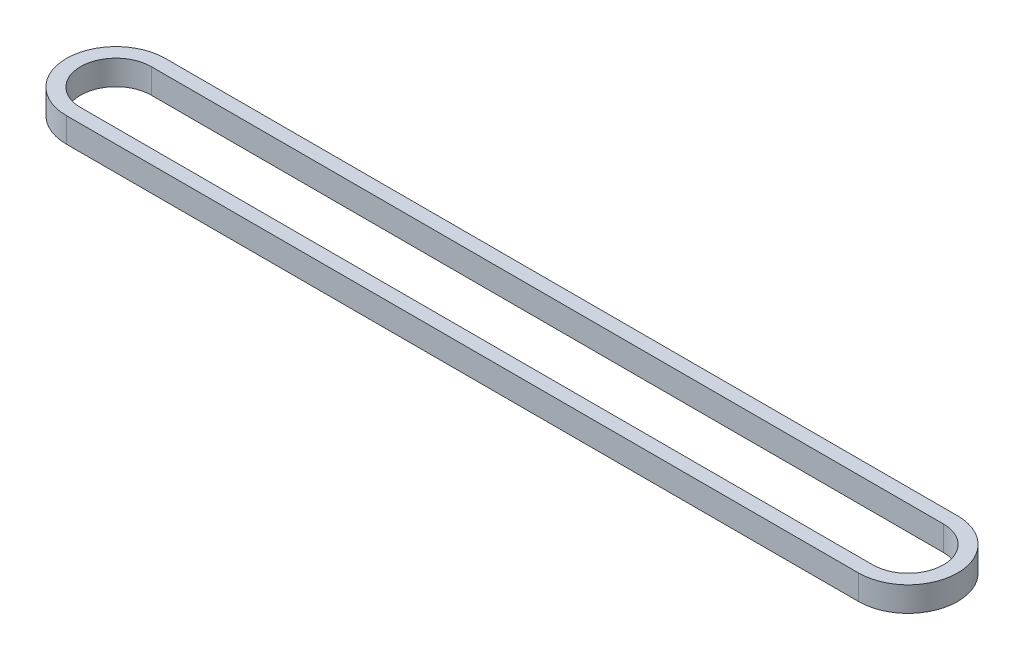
ISO-10303-21;
HEADER;
FILE_DESCRIPTION(('STEP AP214'),'2;1');
FILE_NAME('part.step','',(''),(''),'','','');
FILE_SCHEMA(('AUTOMOTIVE_DESIGN { 1 0 10303 214 1 1 1 1 }'));
ENDSEC;
DATA;
#1=APPLICATION_CONTEXT('core data for automotive mechanical design processes');
#2=APPLICATION_PROTOCOL_DEFINITION('international standard','automotive_design',2000,#1);
#3=PRODUCT_CONTEXT('',#1,'mechanical');
#4=PRODUCT('Part','Part','',(#3));
#5=PRODUCT_RELATED_PRODUCT_CATEGORY('part','',(#4));
#6=PRODUCT_DEFINITION_FORMATION('','',#4);
#7=PRODUCT_DEFINITION_CONTEXT('part definition',#1,'design');
#8=PRODUCT_DEFINITION('design','',#6,#7);
#9=PRODUCT_DEFINITION_SHAPE('','',#8);
#10=(LENGTH_UNIT() NAMED_UNIT(*) SI_UNIT(.MILLI.,.METRE.));
#11=(NAMED_UNIT(*) PLANE_ANGLE_UNIT() SI_UNIT($,.RADIAN.));
#12=(NAMED_UNIT(*) SI_UNIT($,.STERADIAN.) SOLID_ANGLE_UNIT());
#13=UNCERTAINTY_MEASURE_WITH_UNIT(LENGTH_MEASURE(1.E-05),#10,'distance_accuracy_value','');
#14=(GEOMETRIC_REPRESENTATION_CONTEXT(3) GLOBAL_UNCERTAINTY_ASSIGNED_CONTEXT((#13)) GLOBAL_UNIT_ASSIGNED_CONTEXT((#10,
#11,#12)) REPRESENTATION_CONTEXT('',''));
#15=CARTESIAN_POINT('',(0.,0.,0.));
#16=DIRECTION('',(0.,0.,1.));
#17=DIRECTION('',(1.,0.,0.));
#18=AXIS2_PLACEMENT_3D('',#15,#16,#17);
#19=CARTESIAN_POINT('',(0.,3.5,0.));
#20=DIRECTION('',(0.,1.,0.));
#21=DIRECTION('',(0.,0.,1.));
#22=AXIS2_PLACEMENT_3D('',#19,#20,#21);
#23=PLANE('',#22);
#24=CARTESIAN_POINT('',(0.,3.5,0.));
#25=DIRECTION('',(0.,1.,0.));
#26=DIRECTION('',(0.,0.,1.));
#27=AXIS2_PLACEMENT_3D('',#24,#25,#26);
#28=CIRCLE('',#27,7.);
#29=CARTESIAN_POINT('',(0.,3.5,7.));
#30=VERTEX_POINT('',#29);
#31=CARTESIAN_POINT('',(0.,3.5,-7.));
#32=VERTEX_POINT('',#31);
#33=EDGE_CURVE('E159',#30,#32,#28,.T.);
#34=ORIENTED_EDGE('',*,*,#33,.T.);
#35=DIRECTION('',(-1.,0.,0.));
#36=VECTOR('',#35,1.);
#37=CARTESIAN_POINT('',(0.,3.5,-7.));
#38=LINE('',#37,#36);
#39=CARTESIAN_POINT('',(-112.,3.5,-6.99999999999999));
#40=VERTEX_POINT('',#39);
#41=EDGE_CURVE('E163',#32,#40,#38,.T.);
#42=ORIENTED_EDGE('',*,*,#41,.T.);
#43=CARTESIAN_POINT('',(-112.,3.5,0.));
#44=DIRECTION('',(0.,1.,0.));
#45=DIRECTION('',(0.,0.,1.));
#46=AXIS2_PLACEMENT_3D('',#43,#44,#45);
#47=CIRCLE('',#46,7.);
#48=CARTESIAN_POINT('',(-112.,3.5,7.00000000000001));
#49=VERTEX_POINT('',#48);
#50=EDGE_CURVE('E167',#40,#49,#47,.T.);
#51=ORIENTED_EDGE('',*,*,#50,.T.);
#52=DIRECTION('',(1.,0.,0.));
#53=VECTOR('',#52,1.);
#54=CARTESIAN_POINT('',(0.,3.5,7.));
#55=LINE('',#54,#53);
#56=EDGE_CURVE('E170',#49,#30,#55,.T.);
#57=ORIENTED_EDGE('',*,*,#56,.T.);
#58=EDGE_LOOP('',(#34,#42,#51,#57));
#59=FACE_BOUND('',#58,.T.);
#60=DIRECTION('',(-1.,0.,0.));
#61=VECTOR('',#60,1.);
#62=CARTESIAN_POINT('',(0.,3.5,-5.));
#63=LINE('',#62,#61);
#64=CARTESIAN_POINT('',(0.,3.5,-5.));
#65=VERTEX_POINT('',#64);
#66=CARTESIAN_POINT('',(-112.,3.5,-4.99999999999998));
#67=VERTEX_POINT('',#66);
#68=EDGE_CURVE('E120',#65,#67,#63,.T.);
#69=ORIENTED_EDGE('',*,*,#68,.F.);
#70=CARTESIAN_POINT('',(0.,3.5,0.));
#71=DIRECTION('',(0.,1.,0.));
#72=DIRECTION('',(0.,0.,1.));
#73=AXIS2_PLACEMENT_3D('',#70,#71,#72);
#74=CIRCLE('',#73,5.);
#75=CARTESIAN_POINT('',(0.,3.5,5.));
#76=VERTEX_POINT('',#75);
#77=EDGE_CURVE('E111',#76,#65,#74,.T.);
#78=ORIENTED_EDGE('',*,*,#77,.F.);
#79=DIRECTION('',(1.,0.,0.));
#80=VECTOR('',#79,1.);
#81=CARTESIAN_POINT('',(0.,3.5,5.));
#82=LINE('',#81,#80);
#83=CARTESIAN_POINT('',(-112.,3.5,5.00000000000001));
#84=VERTEX_POINT('',#83);
#85=EDGE_CURVE('E137',#84,#76,#82,.T.);
#86=ORIENTED_EDGE('',*,*,#85,.F.);
#87=CARTESIAN_POINT('',(-112.,3.5,0.));
#88=DIRECTION('',(0.,1.,0.));
#89=DIRECTION('',(0.,0.,1.));
#90=AXIS2_PLACEMENT_3D('',#87,#88,#89);
#91=CIRCLE('',#90,5.);
#92=EDGE_CURVE('E133',#67,#84,#91,.T.);
#93=ORIENTED_EDGE('',*,*,#92,.F.);
#94=EDGE_LOOP('',(#69,#78,#86,#93));
#95=FACE_BOUND('',#94,.T.);
#96=ADVANCED_FACE('F45',(#59,#95),#23,.T.);
#97=CARTESIAN_POINT('',(0.,0.,0.));
#98=DIRECTION('',(0.,1.,0.));
#99=DIRECTION('',(0.,0.,1.));
#100=AXIS2_PLACEMENT_3D('',#97,#98,#99);
#101=PLANE('',#100);
#102=CARTESIAN_POINT('',(0.,0.,0.));
#103=DIRECTION('',(0.,1.,0.));
#104=DIRECTION('',(0.,0.,1.));
#105=AXIS2_PLACEMENT_3D('',#102,#103,#104);
#106=CIRCLE('',#105,7.);
#107=CARTESIAN_POINT('',(0.,0.,7.));
#108=VERTEX_POINT('',#107);
#109=CARTESIAN_POINT('',(0.,0.,-7.));
#110=VERTEX_POINT('',#109);
#111=EDGE_CURVE('E129',#108,#110,#106,.T.);
#112=ORIENTED_EDGE('',*,*,#111,.F.);
#113=DIRECTION('',(1.,0.,0.));
#114=VECTOR('',#113,1.);
#115=CARTESIAN_POINT('',(0.,0.,7.));
#116=LINE('',#115,#114);
#117=CARTESIAN_POINT('',(-112.,0.,7.00000000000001));
#118=VERTEX_POINT('',#117);
#119=EDGE_CURVE('E164',#118,#108,#116,.T.);
#120=ORIENTED_EDGE('',*,*,#119,.F.);
#121=CARTESIAN_POINT('',(-112.,0.,0.));
#122=DIRECTION('',(0.,1.,0.));
#123=DIRECTION('',(0.,0.,1.));
#124=AXIS2_PLACEMENT_3D('',#121,#122,#123);
#125=CIRCLE('',#124,7.);
#126=CARTESIAN_POINT('',(-112.,0.,-6.99999999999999));
#127=VERTEX_POINT('',#126);
#128=EDGE_CURVE('E180',#127,#118,#125,.T.);
#129=ORIENTED_EDGE('',*,*,#128,.F.);
#130=DIRECTION('',(-1.,0.,0.));
#131=VECTOR('',#130,1.);
#132=CARTESIAN_POINT('',(0.,0.,-7.));
#133=LINE('',#132,#131);
#134=EDGE_CURVE('E177',#110,#127,#133,.T.);
#135=ORIENTED_EDGE('',*,*,#134,.F.);
#136=EDGE_LOOP('',(#112,#120,#129,#135));
#137=FACE_BOUND('',#136,.T.);
#138=CARTESIAN_POINT('',(0.,0.,0.));
#139=DIRECTION('',(0.,1.,0.));
#140=DIRECTION('',(0.,0.,1.));
#141=AXIS2_PLACEMENT_3D('',#138,#139,#140);
#142=CIRCLE('',#141,5.);
#143=CARTESIAN_POINT('',(0.,0.,5.));
#144=VERTEX_POINT('',#143);
#145=CARTESIAN_POINT('',(0.,0.,-5.));
#146=VERTEX_POINT('',#145);
#147=EDGE_CURVE('E69',#144,#146,#142,.T.);
#148=ORIENTED_EDGE('',*,*,#147,.T.);
#149=DIRECTION('',(-1.,0.,0.));
#150=VECTOR('',#149,1.);
#151=CARTESIAN_POINT('',(0.,0.,-5.));
#152=LINE('',#151,#150);
#153=CARTESIAN_POINT('',(-112.,0.,-4.99999999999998));
#154=VERTEX_POINT('',#153);
#155=EDGE_CURVE('E127',#146,#154,#152,.T.);
#156=ORIENTED_EDGE('',*,*,#155,.T.);
#157=CARTESIAN_POINT('',(-112.,0.,0.));
#158=DIRECTION('',(0.,1.,0.));
#159=DIRECTION('',(0.,0.,1.));
#160=AXIS2_PLACEMENT_3D('',#157,#158,#159);
#161=CIRCLE('',#160,5.);
#162=CARTESIAN_POINT('',(-112.,0.,5.00000000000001));
#163=VERTEX_POINT('',#162);
#164=EDGE_CURVE('E146',#154,#163,#161,.T.);
#165=ORIENTED_EDGE('',*,*,#164,.T.);
#166=DIRECTION('',(1.,0.,0.));
#167=VECTOR('',#166,1.);
#168=CARTESIAN_POINT('',(0.,0.,5.));
#169=LINE('',#168,#167);
#170=EDGE_CURVE('E121',#163,#144,#169,.T.);
#171=ORIENTED_EDGE('',*,*,#170,.T.);
#172=EDGE_LOOP('',(#148,#156,#165,#171));
#173=FACE_BOUND('',#172,.T.);
#174=ADVANCED_FACE('F203',(#137,#173),#101,.F.);
#175=CARTESIAN_POINT('',(0.,3.5,0.));
#176=DIRECTION('',(0.,-1.,0.));
#177=DIRECTION('',(0.,0.,-1.));
#178=AXIS2_PLACEMENT_3D('',#175,#176,#177);
#179=CYLINDRICAL_SURFACE('',#178,7.);
#180=ORIENTED_EDGE('',*,*,#111,.T.);
#181=DIRECTION('',(0.,-1.,0.));
#182=VECTOR('',#181,1.);
#183=CARTESIAN_POINT('',(0.,3.5,-7.));
#184=LINE('',#183,#182);
#185=EDGE_CURVE('E11',#32,#110,#184,.T.);
#186=ORIENTED_EDGE('',*,*,#185,.F.);
#187=ORIENTED_EDGE('',*,*,#33,.F.);
#188=DIRECTION('',(0.,-1.,0.));
#189=VECTOR('',#188,1.);
#190=CARTESIAN_POINT('',(0.,3.5,7.));
#191=LINE('',#190,#189);
#192=EDGE_CURVE('E173',#30,#108,#191,.T.);
#193=ORIENTED_EDGE('',*,*,#192,.T.);
#194=EDGE_LOOP('',(#180,#186,#187,#193));
#195=FACE_BOUND('',#194,.T.);
#196=ADVANCED_FACE('F47',(#195),#179,.T.);
#197=CARTESIAN_POINT('',(0.,3.5,-7.));
#198=DIRECTION('',(0.,0.,1.));
#199=DIRECTION('',(1.,0.,0.));
#200=AXIS2_PLACEMENT_3D('',#197,#198,#199);
#201=PLANE('',#200);
#202=ORIENTED_EDGE('',*,*,#134,.T.);
#203=DIRECTION('',(0.,-1.,0.));
#204=VECTOR('',#203,1.);
#205=CARTESIAN_POINT('',(-112.,3.5,-6.99999999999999));
#206=LINE('',#205,#204);
#207=EDGE_CURVE('E54',#40,#127,#206,.T.);
#208=ORIENTED_EDGE('',*,*,#207,.F.);
#209=ORIENTED_EDGE('',*,*,#41,.F.);
#210=ORIENTED_EDGE('',*,*,#185,.T.);
#211=EDGE_LOOP('',(#202,#208,#209,#210));
#212=FACE_BOUND('',#211,.T.);
#213=ADVANCED_FACE('F213',(#212),#201,.F.);
#214=CARTESIAN_POINT('',(-112.,3.5,0.));
#215=DIRECTION('',(0.,-1.,0.));
#216=DIRECTION('',(0.,0.,-1.));
#217=AXIS2_PLACEMENT_3D('',#214,#215,#216);
#218=CYLINDRICAL_SURFACE('',#217,7.);
#219=ORIENTED_EDGE('',*,*,#128,.T.);
#220=DIRECTION('',(0.,-1.,0.));
#221=VECTOR('',#220,1.);
#222=CARTESIAN_POINT('',(-112.,3.5,7.00000000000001));
#223=LINE('',#222,#221);
#224=EDGE_CURVE('E188',#49,#118,#223,.T.);
#225=ORIENTED_EDGE('',*,*,#224,.F.);
#226=ORIENTED_EDGE('',*,*,#50,.F.);
#227=ORIENTED_EDGE('',*,*,#207,.T.);
#228=EDGE_LOOP('',(#219,#225,#226,#227));
#229=FACE_BOUND('',#228,.T.);
#230=ADVANCED_FACE('F197',(#229),#218,.T.);
#231=CARTESIAN_POINT('',(0.,3.5,7.));
#232=DIRECTION('',(0.,0.,-1.));
#233=DIRECTION('',(-1.,0.,0.));
#234=AXIS2_PLACEMENT_3D('',#231,#232,#233);
#235=PLANE('',#234);
#236=ORIENTED_EDGE('',*,*,#119,.T.);
#237=ORIENTED_EDGE('',*,*,#192,.F.);
#238=ORIENTED_EDGE('',*,*,#56,.F.);
#239=ORIENTED_EDGE('',*,*,#224,.T.);
#240=EDGE_LOOP('',(#236,#237,#238,#239));
#241=FACE_BOUND('',#240,.T.);
#242=ADVANCED_FACE('F207',(#241),#235,.F.);
#243=CARTESIAN_POINT('',(0.,3.5,0.));
#244=DIRECTION('',(0.,-1.,0.));
#245=DIRECTION('',(0.,0.,-1.));
#246=AXIS2_PLACEMENT_3D('',#243,#244,#245);
#247=CYLINDRICAL_SURFACE('',#246,5.);
#248=ORIENTED_EDGE('',*,*,#147,.F.);
#249=DIRECTION('',(0.,-1.,0.));
#250=VECTOR('',#249,1.);
#251=CARTESIAN_POINT('',(0.,3.5,5.));
#252=LINE('',#251,#250);
#253=EDGE_CURVE('E115',#76,#144,#252,.T.);
#254=ORIENTED_EDGE('',*,*,#253,.F.);
#255=ORIENTED_EDGE('',*,*,#77,.T.);
#256=DIRECTION('',(0.,-1.,0.));
#257=VECTOR('',#256,1.);
#258=CARTESIAN_POINT('',(0.,3.5,-5.));
#259=LINE('',#258,#257);
#260=EDGE_CURVE('E114',#65,#146,#259,.T.);
#261=ORIENTED_EDGE('',*,*,#260,.T.);
#262=EDGE_LOOP('',(#248,#254,#255,#261));
#263=FACE_BOUND('',#262,.T.);
#264=ADVANCED_FACE('F113',(#263),#247,.F.);
#265=CARTESIAN_POINT('',(0.,3.5,-5.));
#266=DIRECTION('',(0.,0.,1.));
#267=DIRECTION('',(1.,0.,0.));
#268=AXIS2_PLACEMENT_3D('',#265,#266,#267);
#269=PLANE('',#268);
#270=ORIENTED_EDGE('',*,*,#155,.F.);
#271=ORIENTED_EDGE('',*,*,#260,.F.);
#272=ORIENTED_EDGE('',*,*,#68,.T.);
#273=DIRECTION('',(0.,-1.,0.));
#274=VECTOR('',#273,1.);
#275=CARTESIAN_POINT('',(-112.,3.5,-4.99999999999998));
#276=LINE('',#275,#274);
#277=EDGE_CURVE('E130',#67,#154,#276,.T.);
#278=ORIENTED_EDGE('',*,*,#277,.T.);
#279=EDGE_LOOP('',(#270,#271,#272,#278));
#280=FACE_BOUND('',#279,.T.);
#281=ADVANCED_FACE('F124',(#280),#269,.T.);
#282=CARTESIAN_POINT('',(-112.,3.5,0.));
#283=DIRECTION('',(0.,-1.,0.));
#284=DIRECTION('',(0.,0.,-1.));
#285=AXIS2_PLACEMENT_3D('',#282,#283,#284);
#286=CYLINDRICAL_SURFACE('',#285,5.);
#287=ORIENTED_EDGE('',*,*,#164,.F.);
#288=ORIENTED_EDGE('',*,*,#277,.F.);
#289=ORIENTED_EDGE('',*,*,#92,.T.);
#290=DIRECTION('',(0.,-1.,0.));
#291=VECTOR('',#290,1.);
#292=CARTESIAN_POINT('',(-112.,3.5,5.00000000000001));
#293=LINE('',#292,#291);
#294=EDGE_CURVE('E61',#84,#163,#293,.T.);
#295=ORIENTED_EDGE('',*,*,#294,.T.);
#296=EDGE_LOOP('',(#287,#288,#289,#295));
#297=FACE_BOUND('',#296,.T.);
#298=ADVANCED_FACE('F236',(#297),#286,.F.);
#299=CARTESIAN_POINT('',(0.,3.5,5.));
#300=DIRECTION('',(0.,0.,-1.));
#301=DIRECTION('',(-1.,0.,0.));
#302=AXIS2_PLACEMENT_3D('',#299,#300,#301);
#303=PLANE('',#302);
#304=ORIENTED_EDGE('',*,*,#170,.F.);
#305=ORIENTED_EDGE('',*,*,#294,.F.);
#306=ORIENTED_EDGE('',*,*,#85,.T.);
#307=ORIENTED_EDGE('',*,*,#253,.T.);
#308=EDGE_LOOP('',(#304,#305,#306,#307));
#309=FACE_BOUND('',#308,.T.);
#310=ADVANCED_FACE('F240',(#309),#303,.T.);
#311=CLOSED_SHELL('',(#96,#174,#196,#213,#230,#242,#264,#281,#298,#310));
#312=MANIFOLD_SOLID_BREP('B2',#311);
#313=ADVANCED_BREP_SHAPE_REPRESENTATION('',(#18,#312),#14);
#314=SHAPE_DEFINITION_REPRESENTATION(#9,#313);
ENDSEC;
END-ISO-10303-21;
